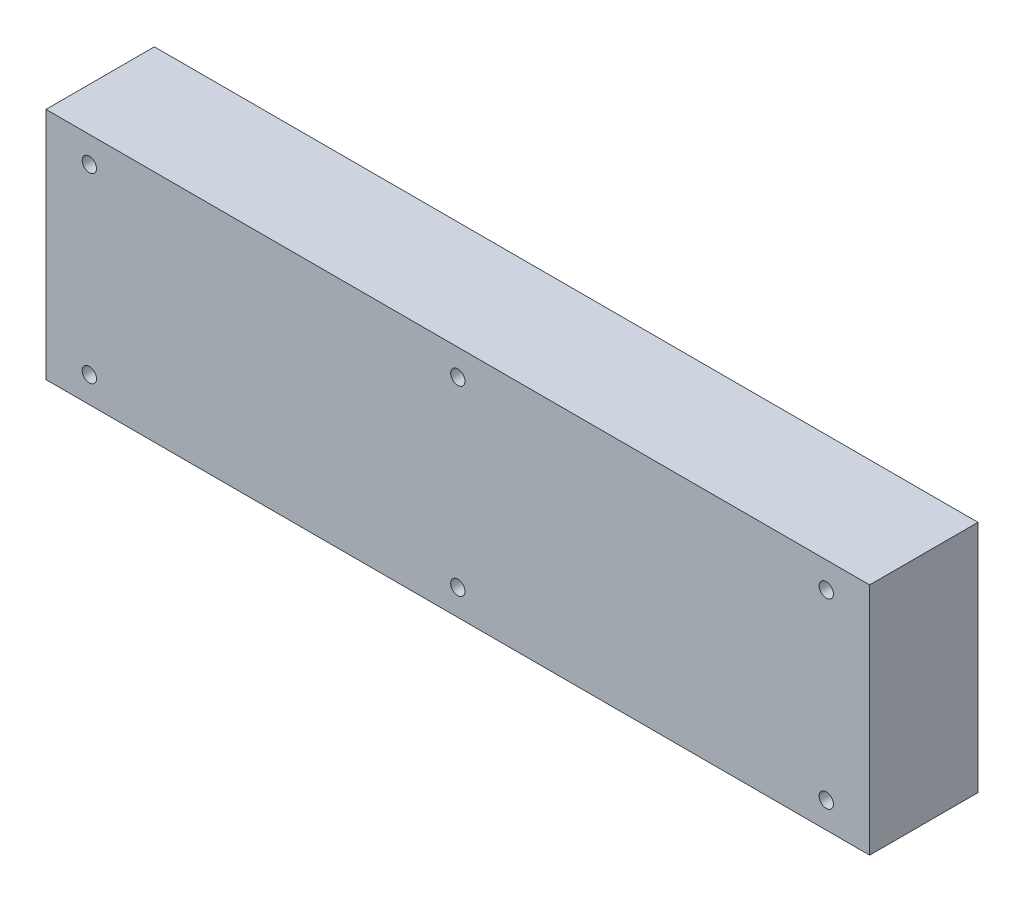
from build123d import *

# Parameters (mm, degrees)
SKETCH_1_W          = 190
SKETCH_1_H          = 54
EXTRUDE_1_DEPTH     = 25
SKETCH_2_R          = 1.65
CUT_EXTRUDE_1_DEPTH = 15
SKETCH_6_R          = 2.5
CUT_EXTRUDE_2_DEPTH = 15


with BuildPart() as part:
    # Sketch 1 → Extrude 1 (new body)
    with BuildSketch(Plane.XY):
        with Locations((95, 27)):
            Rectangle(SKETCH_1_W, SKETCH_1_H)
    extrude(amount=EXTRUDE_1_DEPTH)

    # Sketch 2 → Cut-Extrude 1 (cut)
    with BuildSketch(Plane.XY.offset(25)):
        with Locations((10, 48)):
            Circle(SKETCH_2_R)
        with Locations((95, 48)):
            Circle(SKETCH_2_R)
        with Locations((180, 48)):
            Circle(SKETCH_2_R)
        with Locations((180, 6)):
            Circle(SKETCH_2_R)
        with Locations((95, 6)):
            Circle(SKETCH_2_R)
        with Locations((10, 6)):
            Circle(SKETCH_2_R)
    extrude(amount=-CUT_EXTRUDE_1_DEPTH, mode=Mode.SUBTRACT)

    # Sketch 6 → Cut-Extrude 2 (cut)
    with BuildSketch(Plane(origin=(0, 0, 0), x_dir=(-1, 0, 0), z_dir=(0, 0, -1))):
        with Locations((-170, 27)):
            Circle(SKETCH_6_R)
        with Locations((-95, 27)):
            Circle(SKETCH_6_R)
        with Locations((-20, 27)):
            Circle(SKETCH_6_R)
    extrude(amount=-CUT_EXTRUDE_2_DEPTH, mode=Mode.SUBTRACT)


solid = part.part
